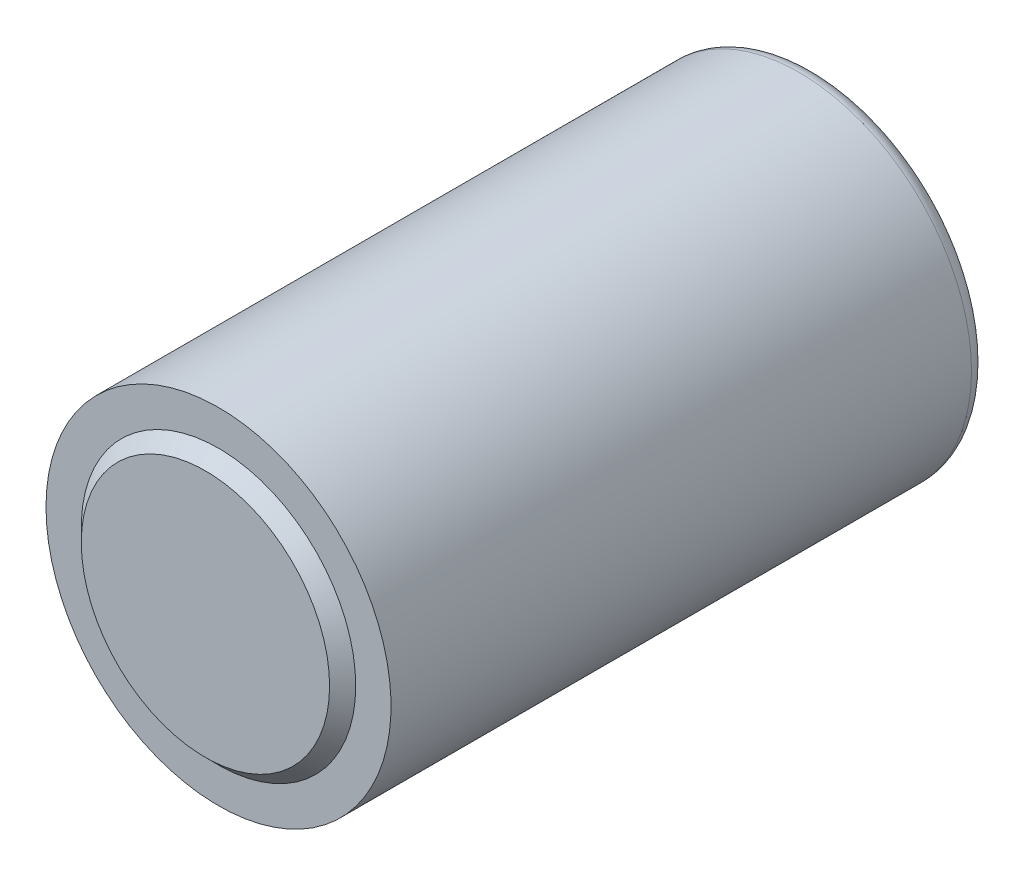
ISO-10303-21;
HEADER;
FILE_DESCRIPTION(('STEP AP214'),'2;1');
FILE_NAME('part.step','',(''),(''),'','','');
FILE_SCHEMA(('AUTOMOTIVE_DESIGN { 1 0 10303 214 1 1 1 1 }'));
ENDSEC;
DATA;
#1=APPLICATION_CONTEXT('core data for automotive mechanical design processes');
#2=APPLICATION_PROTOCOL_DEFINITION('international standard','automotive_design',2000,#1);
#3=PRODUCT_CONTEXT('',#1,'mechanical');
#4=PRODUCT('Part','Part','',(#3));
#5=PRODUCT_RELATED_PRODUCT_CATEGORY('part','',(#4));
#6=PRODUCT_DEFINITION_FORMATION('','',#4);
#7=PRODUCT_DEFINITION_CONTEXT('part definition',#1,'design');
#8=PRODUCT_DEFINITION('design','',#6,#7);
#9=PRODUCT_DEFINITION_SHAPE('','',#8);
#10=(LENGTH_UNIT() NAMED_UNIT(*) SI_UNIT(.MILLI.,.METRE.));
#11=(NAMED_UNIT(*) PLANE_ANGLE_UNIT() SI_UNIT($,.RADIAN.));
#12=(NAMED_UNIT(*) SI_UNIT($,.STERADIAN.) SOLID_ANGLE_UNIT());
#13=UNCERTAINTY_MEASURE_WITH_UNIT(LENGTH_MEASURE(1.E-05),#10,'distance_accuracy_value','');
#14=(GEOMETRIC_REPRESENTATION_CONTEXT(3) GLOBAL_UNCERTAINTY_ASSIGNED_CONTEXT((#13)) GLOBAL_UNIT_ASSIGNED_CONTEXT((#10,
#11,#12)) REPRESENTATION_CONTEXT('',''));
#15=CARTESIAN_POINT('',(0.,0.,0.));
#16=DIRECTION('',(0.,0.,1.));
#17=DIRECTION('',(1.,0.,0.));
#18=AXIS2_PLACEMENT_3D('',#15,#16,#17);
#19=CARTESIAN_POINT('',(0.,0.,59.2074));
#20=DIRECTION('',(0.,0.,-1.));
#21=DIRECTION('',(-1.,0.,0.));
#22=AXIS2_PLACEMENT_3D('',#19,#20,#21);
#23=CYLINDRICAL_SURFACE('',#22,16.764);
#24=CARTESIAN_POINT('',(0.,0.,1.524));
#25=DIRECTION('',(0.,0.,1.));
#26=DIRECTION('',(1.,0.,0.));
#27=AXIS2_PLACEMENT_3D('',#24,#25,#26);
#28=CIRCLE('',#27,16.764);
#29=CARTESIAN_POINT('',(-16.764,0.,1.52399999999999));
#30=VERTEX_POINT('',#29);
#31=EDGE_CURVE('E36',#30,#30,#28,.T.);
#32=CARTESIAN_POINT('',(0.,0.,57.9374));
#33=DIRECTION('',(0.,0.,1.));
#34=DIRECTION('',(1.,0.,0.));
#35=AXIS2_PLACEMENT_3D('',#32,#33,#34);
#36=CIRCLE('',#35,16.764);
#37=CARTESIAN_POINT('',(-16.764,0.,57.9374));
#38=VERTEX_POINT('',#37);
#39=EDGE_CURVE('E44',#38,#38,#36,.T.);
#40=CARTESIAN_POINT('',(-16.764,0.,1.52399999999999));
#41=CARTESIAN_POINT('',(-16.764,0.,2.11163958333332));
#42=CARTESIAN_POINT('',(-16.764,0.,2.69927916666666));
#43=CARTESIAN_POINT('',(-16.764,0.,3.87455833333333));
#44=CARTESIAN_POINT('',(-16.764,0.,4.46219791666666));
#45=CARTESIAN_POINT('',(-16.764,0.,5.63747708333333));
#46=CARTESIAN_POINT('',(-16.764,0.,6.22511666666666));
#47=CARTESIAN_POINT('',(-16.764,0.,7.40039583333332));
#48=CARTESIAN_POINT('',(-16.764,0.,7.98803541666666));
#49=CARTESIAN_POINT('',(-16.764,0.,9.16331458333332));
#50=CARTESIAN_POINT('',(-16.764,0.,9.75095416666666));
#51=CARTESIAN_POINT('',(-16.764,0.,10.9262333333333));
#52=CARTESIAN_POINT('',(-16.764,0.,11.5138729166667));
#53=CARTESIAN_POINT('',(-16.764,0.,12.6891520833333));
#54=CARTESIAN_POINT('',(-16.764,0.,13.2767916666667));
#55=CARTESIAN_POINT('',(-16.764,0.,14.4520708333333));
#56=CARTESIAN_POINT('',(-16.764,0.,15.0397104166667));
#57=CARTESIAN_POINT('',(-16.764,0.,16.2149895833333));
#58=CARTESIAN_POINT('',(-16.764,0.,16.8026291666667));
#59=CARTESIAN_POINT('',(-16.764,0.,17.9779083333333));
#60=CARTESIAN_POINT('',(-16.764,0.,18.5655479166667));
#61=CARTESIAN_POINT('',(-16.764,0.,19.7408270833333));
#62=CARTESIAN_POINT('',(-16.764,0.,20.3284666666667));
#63=CARTESIAN_POINT('',(-16.764,0.,21.5037458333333));
#64=CARTESIAN_POINT('',(-16.764,0.,22.0913854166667));
#65=CARTESIAN_POINT('',(-16.764,0.,23.2666645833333));
#66=CARTESIAN_POINT('',(-16.764,0.,23.8543041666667));
#67=CARTESIAN_POINT('',(-16.764,0.,25.0295833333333));
#68=CARTESIAN_POINT('',(-16.764,0.,25.6172229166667));
#69=CARTESIAN_POINT('',(-16.764,0.,26.7925020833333));
#70=CARTESIAN_POINT('',(-16.764,0.,27.3801416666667));
#71=CARTESIAN_POINT('',(-16.764,0.,28.5554208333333));
#72=CARTESIAN_POINT('',(-16.764,0.,29.1430604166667));
#73=CARTESIAN_POINT('',(-16.764,0.,30.3183395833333));
#74=CARTESIAN_POINT('',(-16.764,0.,30.9059791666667));
#75=CARTESIAN_POINT('',(-16.764,0.,32.0812583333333));
#76=CARTESIAN_POINT('',(-16.764,0.,32.6688979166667));
#77=CARTESIAN_POINT('',(-16.764,0.,33.8441770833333));
#78=CARTESIAN_POINT('',(-16.764,0.,34.4318166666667));
#79=CARTESIAN_POINT('',(-16.764,0.,35.6070958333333));
#80=CARTESIAN_POINT('',(-16.764,0.,36.1947354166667));
#81=CARTESIAN_POINT('',(-16.764,0.,37.3700145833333));
#82=CARTESIAN_POINT('',(-16.764,0.,37.9576541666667));
#83=CARTESIAN_POINT('',(-16.764,0.,39.1329333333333));
#84=CARTESIAN_POINT('',(-16.764,0.,39.7205729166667));
#85=CARTESIAN_POINT('',(-16.764,0.,40.8958520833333));
#86=CARTESIAN_POINT('',(-16.764,0.,41.4834916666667));
#87=CARTESIAN_POINT('',(-16.764,0.,42.6587708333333));
#88=CARTESIAN_POINT('',(-16.764,0.,43.2464104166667));
#89=CARTESIAN_POINT('',(-16.764,0.,44.4216895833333));
#90=CARTESIAN_POINT('',(-16.764,0.,45.0093291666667));
#91=CARTESIAN_POINT('',(-16.764,0.,46.1846083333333));
#92=CARTESIAN_POINT('',(-16.764,0.,46.7722479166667));
#93=CARTESIAN_POINT('',(-16.764,0.,47.9475270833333));
#94=CARTESIAN_POINT('',(-16.764,0.,48.5351666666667));
#95=CARTESIAN_POINT('',(-16.764,0.,49.7104458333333));
#96=CARTESIAN_POINT('',(-16.764,0.,50.2980854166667));
#97=CARTESIAN_POINT('',(-16.764,0.,51.4733645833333));
#98=CARTESIAN_POINT('',(-16.764,0.,52.0610041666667));
#99=CARTESIAN_POINT('',(-16.764,0.,53.2362833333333));
#100=CARTESIAN_POINT('',(-16.764,0.,53.8239229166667));
#101=CARTESIAN_POINT('',(-16.764,0.,54.9992020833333));
#102=CARTESIAN_POINT('',(-16.764,0.,55.5868416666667));
#103=CARTESIAN_POINT('',(-16.764,0.,56.7621208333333));
#104=CARTESIAN_POINT('',(-16.764,0.,57.3497604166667));
#105=CARTESIAN_POINT('',(-16.764,0.,57.9374));
#106=B_SPLINE_CURVE_WITH_KNOTS('',3,(#40,#41,#42,#43,#44,#45,#46,#47,#48,#49,#50,#51,#52,#53,
#54,#55,#56,#57,#58,#59,#60,#61,#62,#63,#64,#65,#66,#67,#68,#69,#70,#71,#72,#73,#74,#75,#76,#77,
#78,#79,#80,#81,#82,#83,#84,#85,#86,#87,#88,#89,#90,#91,#92,#93,#94,#95,#96,#97,#98,#99,#100,
#101,#102,#103,#104,#105),.UNSPECIFIED.,.F.,.F.,(4,2,2,2,2,2,2,2,2,2,2,2,2,2,2,2,2,2,2,2,2,2,2,
2,2,2,2,2,2,2,2,2,4),(0.,1.76291875,3.5258375,5.28875625,7.051675,8.81459375,10.5775125,
12.34043125,14.10335,15.86626875,17.6291875,19.39210625,21.155025,22.91794375,24.6808625,
26.44378125,28.2067,29.96961875,31.7325375,33.49545625,35.258375,37.02129375,38.7842125,
40.54713125,42.31005,44.07296875,45.8358875,47.59880625,49.361725,51.12464375,52.8875625,
54.65048125,56.4134),.UNSPECIFIED.);
#107=EDGE_CURVE('BSEAM30',#30,#38,#106,.T.);
#108=ORIENTED_EDGE('',*,*,#31,.T.);
#109=ORIENTED_EDGE('',*,*,#39,.F.);
#110=ORIENTED_EDGE('',*,*,#107,.T.);
#111=ORIENTED_EDGE('',*,*,#107,.F.);
#112=EDGE_LOOP('',(#108,#110,#109,#111));
#113=FACE_BOUND('',#112,.T.);
#114=ADVANCED_FACE('F30',(#113),#23,.T.);
#115=CARTESIAN_POINT('',(0.,0.,0.));
#116=DIRECTION('',(0.,0.,1.));
#117=DIRECTION('',(1.,0.,0.));
#118=AXIS2_PLACEMENT_3D('',#115,#116,#117);
#119=PLANE('',#118);
#120=CARTESIAN_POINT('',(0.,0.,0.));
#121=DIRECTION('',(0.,0.,1.));
#122=DIRECTION('',(1.,0.,0.));
#123=AXIS2_PLACEMENT_3D('',#120,#121,#122);
#124=CIRCLE('',#123,15.24);
#125=CARTESIAN_POINT('',(15.24,0.,0.));
#126=VERTEX_POINT('',#125);
#127=EDGE_CURVE('E10',#126,#126,#124,.F.);
#128=ORIENTED_EDGE('',*,*,#127,.T.);
#129=EDGE_LOOP('',(#128));
#130=FACE_BOUND('',#129,.T.);
#131=ADVANCED_FACE('F70',(#130),#119,.F.);
#132=CARTESIAN_POINT('',(0.,0.,57.9374));
#133=DIRECTION('',(0.,0.,1.));
#134=DIRECTION('',(1.,0.,0.));
#135=AXIS2_PLACEMENT_3D('',#132,#133,#134);
#136=PLANE('',#135);
#137=CARTESIAN_POINT('',(0.,0.,57.9374));
#138=DIRECTION('',(0.,0.,1.));
#139=DIRECTION('',(1.,0.,0.));
#140=AXIS2_PLACEMENT_3D('',#137,#138,#139);
#141=CIRCLE('',#140,13.335);
#142=CARTESIAN_POINT('',(13.335,0.,57.9374));
#143=VERTEX_POINT('',#142);
#144=EDGE_CURVE('E40',#143,#143,#141,.F.);
#145=ORIENTED_EDGE('',*,*,#144,.T.);
#146=EDGE_LOOP('',(#145));
#147=FACE_BOUND('',#146,.T.);
#148=ORIENTED_EDGE('',*,*,#39,.T.);
#149=EDGE_LOOP('',(#148));
#150=FACE_BOUND('',#149,.T.);
#151=ADVANCED_FACE('F66',(#147,#150),#136,.T.);
#152=CARTESIAN_POINT('',(0.,0.,59.2074));
#153=DIRECTION('',(0.,0.,1.));
#154=DIRECTION('',(1.,0.,0.));
#155=AXIS2_PLACEMENT_3D('',#152,#153,#154);
#156=PLANE('',#155);
#157=CARTESIAN_POINT('',(0.,0.,59.2074));
#158=DIRECTION('',(0.,0.,1.));
#159=DIRECTION('',(1.,0.,0.));
#160=AXIS2_PLACEMENT_3D('',#157,#158,#159);
#161=CIRCLE('',#160,12.065);
#162=CARTESIAN_POINT('',(12.065,0.,59.2074));
#163=VERTEX_POINT('',#162);
#164=EDGE_CURVE('E49',#163,#163,#161,.T.);
#165=ORIENTED_EDGE('',*,*,#164,.T.);
#166=EDGE_LOOP('',(#165));
#167=FACE_BOUND('',#166,.T.);
#168=ADVANCED_FACE('F53',(#167),#156,.T.);
#169=CARTESIAN_POINT('',(0.,0.,59.2074));
#170=DIRECTION('',(0.,0.,-1.));
#171=DIRECTION('',(-1.,0.,0.));
#172=AXIS2_PLACEMENT_3D('',#169,#170,#171);
#173=CONICAL_SURFACE('',#172,12.065,0.785398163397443);
#174=ORIENTED_EDGE('',*,*,#144,.F.);
#175=EDGE_LOOP('',(#174));
#176=FACE_BOUND('',#175,.T.);
#177=ORIENTED_EDGE('',*,*,#164,.F.);
#178=EDGE_LOOP('',(#177));
#179=FACE_BOUND('',#178,.T.);
#180=ADVANCED_FACE('F55',(#176,#179),#173,.T.);
#181=CARTESIAN_POINT('',(0.,0.,1.524));
#182=DIRECTION('',(0.,0.,1.));
#183=DIRECTION('',(1.,0.,0.));
#184=AXIS2_PLACEMENT_3D('',#181,#182,#183);
#185=TOROIDAL_SURFACE('',#184,15.24,1.524);
#186=ORIENTED_EDGE('',*,*,#127,.F.);
#187=EDGE_LOOP('',(#186));
#188=FACE_BOUND('',#187,.T.);
#189=ORIENTED_EDGE('',*,*,#31,.F.);
#190=EDGE_LOOP('',(#189));
#191=FACE_BOUND('',#190,.T.);
#192=ADVANCED_FACE('F57',(#188,#191),#185,.T.);
#193=CLOSED_SHELL('',(#114,#131,#151,#168,#180,#192));
#194=MANIFOLD_SOLID_BREP('B2',#193);
#195=ADVANCED_BREP_SHAPE_REPRESENTATION('',(#18,#194),#14);
#196=SHAPE_DEFINITION_REPRESENTATION(#9,#195);
ENDSEC;
END-ISO-10303-21;
